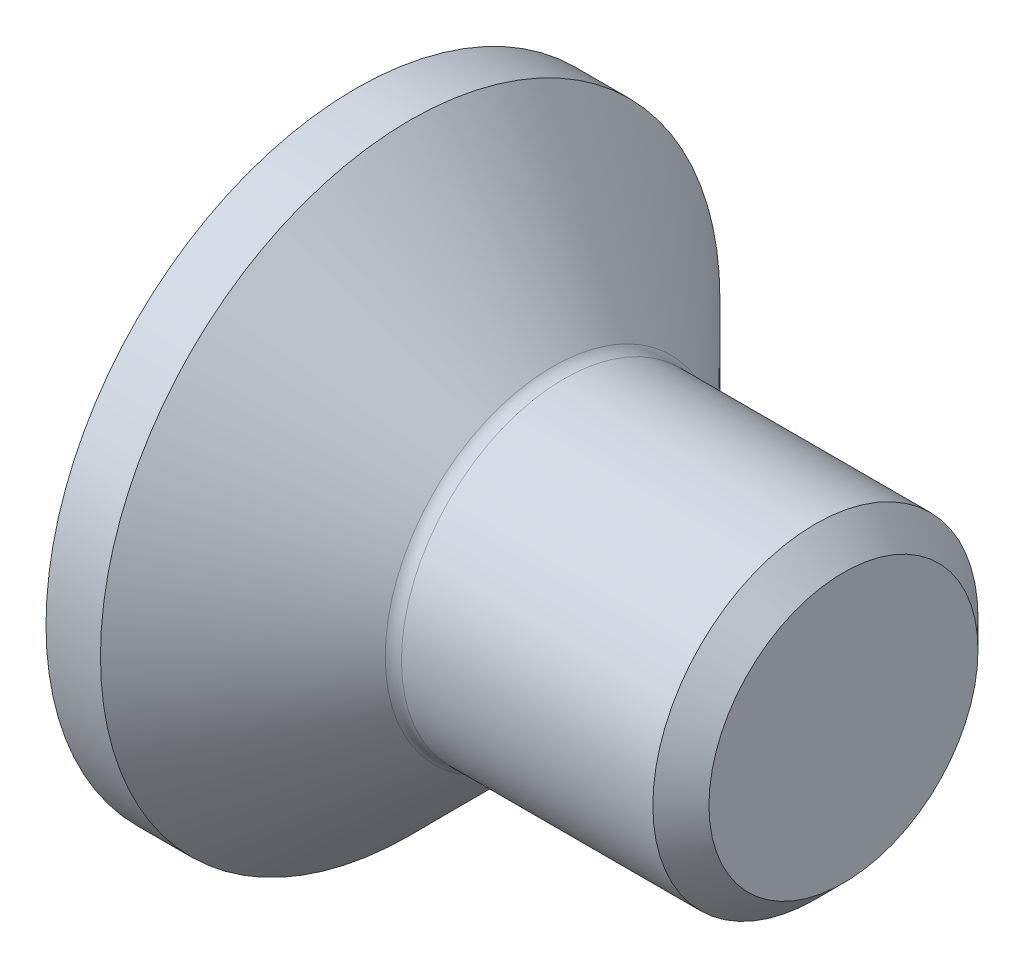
ISO-10303-21;
HEADER;
FILE_DESCRIPTION(('STEP AP214'),'2;1');
FILE_NAME('part.step','',(''),(''),'','','');
FILE_SCHEMA(('AUTOMOTIVE_DESIGN { 1 0 10303 214 1 1 1 1 }'));
ENDSEC;
DATA;
#1=APPLICATION_CONTEXT('core data for automotive mechanical design processes');
#2=APPLICATION_PROTOCOL_DEFINITION('international standard','automotive_design',2000,#1);
#3=PRODUCT_CONTEXT('',#1,'mechanical');
#4=PRODUCT('Part','Part','',(#3));
#5=PRODUCT_RELATED_PRODUCT_CATEGORY('part','',(#4));
#6=PRODUCT_DEFINITION_FORMATION('','',#4);
#7=PRODUCT_DEFINITION_CONTEXT('part definition',#1,'design');
#8=PRODUCT_DEFINITION('design','',#6,#7);
#9=PRODUCT_DEFINITION_SHAPE('','',#8);
#10=(LENGTH_UNIT() NAMED_UNIT(*) SI_UNIT(.MILLI.,.METRE.));
#11=(NAMED_UNIT(*) PLANE_ANGLE_UNIT() SI_UNIT($,.RADIAN.));
#12=(NAMED_UNIT(*) SI_UNIT($,.STERADIAN.) SOLID_ANGLE_UNIT());
#13=UNCERTAINTY_MEASURE_WITH_UNIT(LENGTH_MEASURE(1.E-05),#10,'distance_accuracy_value','');
#14=(GEOMETRIC_REPRESENTATION_CONTEXT(3) GLOBAL_UNCERTAINTY_ASSIGNED_CONTEXT((#13)) GLOBAL_UNIT_ASSIGNED_CONTEXT((#10,
#11,#12)) REPRESENTATION_CONTEXT('',''));
#15=CARTESIAN_POINT('',(0.,0.,0.));
#16=DIRECTION('',(0.,0.,1.));
#17=DIRECTION('',(1.,0.,0.));
#18=AXIS2_PLACEMENT_3D('',#15,#16,#17);
#19=CARTESIAN_POINT('',(0.,0.,0.));
#20=DIRECTION('',(-1.,0.,0.));
#21=DIRECTION('',(0.,0.,1.));
#22=AXIS2_PLACEMENT_3D('',#19,#20,#21);
#23=PLANE('',#22);
#24=CARTESIAN_POINT('',(0.,0.,0.));
#25=DIRECTION('',(-1.,0.,0.));
#26=DIRECTION('',(0.,0.,1.));
#27=AXIS2_PLACEMENT_3D('',#24,#25,#26);
#28=CIRCLE('',#27,7.62);
#29=CARTESIAN_POINT('',(0.,0.,7.62));
#30=VERTEX_POINT('',#29);
#31=EDGE_CURVE('E145',#30,#30,#28,.T.);
#32=ORIENTED_EDGE('',*,*,#31,.T.);
#33=EDGE_LOOP('',(#32));
#34=FACE_BOUND('',#33,.T.);
#35=DIRECTION('',(0.,-0.5,-0.866025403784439));
#36=VECTOR('',#35,1.);
#37=CARTESIAN_POINT('',(0.,-1.44337567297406,2.5));
#38=LINE('',#37,#36);
#39=CARTESIAN_POINT('',(0.,-1.44337567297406,2.5));
#40=VERTEX_POINT('',#39);
#41=CARTESIAN_POINT('',(0.,-2.88675134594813,0.));
#42=VERTEX_POINT('',#41);
#43=EDGE_CURVE('E117',#40,#42,#38,.T.);
#44=ORIENTED_EDGE('',*,*,#43,.T.);
#45=DIRECTION('',(0.,0.5,-0.866025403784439));
#46=VECTOR('',#45,1.);
#47=CARTESIAN_POINT('',(0.,-2.88675134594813,0.));
#48=LINE('',#47,#46);
#49=CARTESIAN_POINT('',(0.,-1.44337567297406,-2.5));
#50=VERTEX_POINT('',#49);
#51=EDGE_CURVE('E47',#42,#50,#48,.T.);
#52=ORIENTED_EDGE('',*,*,#51,.T.);
#53=DIRECTION('',(0.,1.,0.));
#54=VECTOR('',#53,1.);
#55=CARTESIAN_POINT('',(0.,-1.44337567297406,-2.5));
#56=LINE('',#55,#54);
#57=CARTESIAN_POINT('',(0.,1.44337567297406,-2.5));
#58=VERTEX_POINT('',#57);
#59=EDGE_CURVE('E132',#50,#58,#56,.T.);
#60=ORIENTED_EDGE('',*,*,#59,.T.);
#61=DIRECTION('',(0.,0.5,0.866025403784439));
#62=VECTOR('',#61,1.);
#63=CARTESIAN_POINT('',(0.,1.44337567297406,-2.5));
#64=LINE('',#63,#62);
#65=CARTESIAN_POINT('',(0.,2.88675134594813,0.));
#66=VERTEX_POINT('',#65);
#67=EDGE_CURVE('E378',#58,#66,#64,.T.);
#68=ORIENTED_EDGE('',*,*,#67,.T.);
#69=DIRECTION('',(0.,-0.5,0.866025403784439));
#70=VECTOR('',#69,1.);
#71=CARTESIAN_POINT('',(0.,2.88675134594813,0.));
#72=LINE('',#71,#70);
#73=CARTESIAN_POINT('',(0.,1.44337567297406,2.5));
#74=VERTEX_POINT('',#73);
#75=EDGE_CURVE('E381',#66,#74,#72,.T.);
#76=ORIENTED_EDGE('',*,*,#75,.T.);
#77=DIRECTION('',(0.,-1.,0.));
#78=VECTOR('',#77,1.);
#79=CARTESIAN_POINT('',(0.,1.44337567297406,2.5));
#80=LINE('',#79,#78);
#81=EDGE_CURVE('E384',#74,#40,#80,.T.);
#82=ORIENTED_EDGE('',*,*,#81,.T.);
#83=EDGE_LOOP('',(#44,#52,#60,#68,#76,#82));
#84=FACE_BOUND('',#83,.T.);
#85=ADVANCED_FACE('F32',(#34,#84),#23,.T.);
#86=CARTESIAN_POINT('',(12.,3.3095,0.));
#87=DIRECTION('',(1.,0.,0.));
#88=DIRECTION('',(0.,0.,-1.));
#89=AXIS2_PLACEMENT_3D('',#86,#87,#88);
#90=PLANE('',#89);
#91=CARTESIAN_POINT('',(12.,0.,0.));
#92=DIRECTION('',(-1.,0.,0.));
#93=DIRECTION('',(0.,0.,1.));
#94=AXIS2_PLACEMENT_3D('',#91,#92,#93);
#95=CIRCLE('',#94,3.3095);
#96=CARTESIAN_POINT('',(12.,0.,3.3095));
#97=VERTEX_POINT('',#96);
#98=EDGE_CURVE('E155',#97,#97,#95,.T.);
#99=ORIENTED_EDGE('',*,*,#98,.F.);
#100=EDGE_LOOP('',(#99));
#101=FACE_BOUND('',#100,.T.);
#102=ADVANCED_FACE('F175',(#101),#90,.T.);
#103=CARTESIAN_POINT('',(12.,0.,0.));
#104=DIRECTION('',(-1.,0.,0.));
#105=DIRECTION('',(0.,0.,1.));
#106=AXIS2_PLACEMENT_3D('',#103,#104,#105);
#107=CONICAL_SURFACE('',#106,3.3095,0.785398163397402);
#108=CARTESIAN_POINT('',(11.3095,0.,0.));
#109=DIRECTION('',(-1.,0.,0.));
#110=DIRECTION('',(0.,0.,1.));
#111=AXIS2_PLACEMENT_3D('',#108,#109,#110);
#112=CIRCLE('',#111,3.99999999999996);
#113=CARTESIAN_POINT('',(11.3095,0.,3.99999999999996));
#114=VERTEX_POINT('',#113);
#115=EDGE_CURVE('E152',#114,#114,#112,.T.);
#116=ORIENTED_EDGE('',*,*,#115,.F.);
#117=EDGE_LOOP('',(#116));
#118=FACE_BOUND('',#117,.T.);
#119=ORIENTED_EDGE('',*,*,#98,.T.);
#120=EDGE_LOOP('',(#119));
#121=FACE_BOUND('',#120,.T.);
#122=ADVANCED_FACE('F181',(#118,#121),#107,.T.);
#123=CARTESIAN_POINT('',(0.,0.,0.));
#124=DIRECTION('',(-1.,0.,0.));
#125=DIRECTION('',(0.,0.,1.));
#126=AXIS2_PLACEMENT_3D('',#123,#124,#125);
#127=CYLINDRICAL_SURFACE('',#126,3.99999999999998);
#128=CARTESIAN_POINT('',(5.12568542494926,0.,0.));
#129=DIRECTION('',(-1.,0.,0.));
#130=DIRECTION('',(0.,0.,1.));
#131=AXIS2_PLACEMENT_3D('',#128,#129,#130);
#132=CIRCLE('',#131,3.99999999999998);
#133=CARTESIAN_POINT('',(5.12568542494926,0.,3.99999999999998));
#134=VERTEX_POINT('',#133);
#135=EDGE_CURVE('E11',#134,#134,#132,.F.);
#136=ORIENTED_EDGE('',*,*,#135,.T.);
#137=EDGE_LOOP('',(#136));
#138=FACE_BOUND('',#137,.T.);
#139=ORIENTED_EDGE('',*,*,#115,.T.);
#140=EDGE_LOOP('',(#139));
#141=FACE_BOUND('',#140,.T.);
#142=ADVANCED_FACE('F189',(#138,#141),#127,.T.);
#143=CARTESIAN_POINT('',(1.34000000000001,0.,0.));
#144=DIRECTION('',(-1.,0.,0.));
#145=DIRECTION('',(0.,0.,1.));
#146=AXIS2_PLACEMENT_3D('',#143,#144,#145);
#147=CONICAL_SURFACE('',#146,7.62,0.78539816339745);
#148=CARTESIAN_POINT('',(4.84284271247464,0.,0.));
#149=DIRECTION('',(-1.,0.,0.));
#150=DIRECTION('',(0.,0.,1.));
#151=AXIS2_PLACEMENT_3D('',#148,#149,#150);
#152=CIRCLE('',#151,4.11715728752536);
#153=CARTESIAN_POINT('',(4.84284271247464,0.,4.11715728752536));
#154=VERTEX_POINT('',#153);
#155=EDGE_CURVE('E40',#154,#154,#152,.T.);
#156=ORIENTED_EDGE('',*,*,#155,.T.);
#157=EDGE_LOOP('',(#156));
#158=FACE_BOUND('',#157,.T.);
#159=CARTESIAN_POINT('',(1.34000000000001,0.,0.));
#160=DIRECTION('',(-1.,0.,0.));
#161=DIRECTION('',(0.,0.,1.));
#162=AXIS2_PLACEMENT_3D('',#159,#160,#161);
#163=CIRCLE('',#162,7.62);
#164=CARTESIAN_POINT('',(1.34000000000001,0.,7.62));
#165=VERTEX_POINT('',#164);
#166=EDGE_CURVE('E149',#165,#165,#163,.T.);
#167=ORIENTED_EDGE('',*,*,#166,.F.);
#168=EDGE_LOOP('',(#167));
#169=FACE_BOUND('',#168,.T.);
#170=ADVANCED_FACE('F160',(#158,#169),#147,.T.);
#171=CARTESIAN_POINT('',(0.,0.,0.));
#172=DIRECTION('',(-1.,0.,0.));
#173=DIRECTION('',(0.,0.,1.));
#174=AXIS2_PLACEMENT_3D('',#171,#172,#173);
#175=CYLINDRICAL_SURFACE('',#174,7.62);
#176=ORIENTED_EDGE('',*,*,#166,.T.);
#177=EDGE_LOOP('',(#176));
#178=FACE_BOUND('',#177,.T.);
#179=ORIENTED_EDGE('',*,*,#31,.F.);
#180=EDGE_LOOP('',(#179));
#181=FACE_BOUND('',#180,.T.);
#182=ADVANCED_FACE('F164',(#178,#181),#175,.T.);
#183=CARTESIAN_POINT('',(5.12568542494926,0.,0.));
#184=DIRECTION('',(-1.,0.,0.));
#185=DIRECTION('',(0.,0.,1.));
#186=AXIS2_PLACEMENT_3D('',#183,#184,#185);
#187=TOROIDAL_SURFACE('',#186,4.39999999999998,0.4);
#188=ORIENTED_EDGE('',*,*,#135,.F.);
#189=EDGE_LOOP('',(#188));
#190=FACE_BOUND('',#189,.T.);
#191=ORIENTED_EDGE('',*,*,#155,.F.);
#192=EDGE_LOOP('',(#191));
#193=FACE_BOUND('',#192,.T.);
#194=ADVANCED_FACE('F34',(#190,#193),#187,.F.);
#195=CARTESIAN_POINT('',(3.,-2.88675134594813,0.));
#196=DIRECTION('',(0.,0.866025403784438,0.5));
#197=DIRECTION('',(0.,-0.5,0.866025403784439));
#198=AXIS2_PLACEMENT_3D('',#195,#196,#197);
#199=PLANE('',#198);
#200=ORIENTED_EDGE('',*,*,#51,.F.);
#201=DIRECTION('',(-1.,0.,0.));
#202=VECTOR('',#201,1.);
#203=CARTESIAN_POINT('',(3.,-2.88675134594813,0.));
#204=LINE('',#203,#202);
#205=CARTESIAN_POINT('',(3.,-2.88675134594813,0.));
#206=VERTEX_POINT('',#205);
#207=EDGE_CURVE('E375',#206,#42,#204,.T.);
#208=ORIENTED_EDGE('',*,*,#207,.F.);
#209=DIRECTION('',(0.,0.5,-0.866025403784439));
#210=VECTOR('',#209,1.);
#211=CARTESIAN_POINT('',(3.,-2.88675134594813,0.));
#212=LINE('',#211,#210);
#213=CARTESIAN_POINT('',(3.,-2.1650635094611,-1.25));
#214=VERTEX_POINT('',#213);
#215=EDGE_CURVE('E114',#206,#214,#212,.T.);
#216=ORIENTED_EDGE('',*,*,#215,.T.);
#217=CARTESIAN_POINT('',(3.,-1.44337567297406,-2.5));
#218=VERTEX_POINT('',#217);
#219=EDGE_CURVE('E108',#214,#218,#212,.T.);
#220=ORIENTED_EDGE('',*,*,#219,.T.);
#221=DIRECTION('',(-1.,0.,0.));
#222=VECTOR('',#221,1.);
#223=CARTESIAN_POINT('',(3.,-1.44337567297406,-2.5));
#224=LINE('',#223,#222);
#225=EDGE_CURVE('E112',#218,#50,#224,.T.);
#226=ORIENTED_EDGE('',*,*,#225,.T.);
#227=EDGE_LOOP('',(#200,#208,#216,#220,#226));
#228=FACE_BOUND('',#227,.T.);
#229=ADVANCED_FACE('F110',(#228),#199,.T.);
#230=CARTESIAN_POINT('',(3.,-1.44337567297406,-2.5));
#231=DIRECTION('',(0.,0.,1.));
#232=DIRECTION('',(1.,0.,0.));
#233=AXIS2_PLACEMENT_3D('',#230,#231,#232);
#234=PLANE('',#233);
#235=ORIENTED_EDGE('',*,*,#59,.F.);
#236=ORIENTED_EDGE('',*,*,#225,.F.);
#237=DIRECTION('',(0.,1.,0.));
#238=VECTOR('',#237,1.);
#239=CARTESIAN_POINT('',(3.,-1.44337567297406,-2.5));
#240=LINE('',#239,#238);
#241=CARTESIAN_POINT('',(3.,0.,-2.5));
#242=VERTEX_POINT('',#241);
#243=EDGE_CURVE('E120',#218,#242,#240,.T.);
#244=ORIENTED_EDGE('',*,*,#243,.T.);
#245=CARTESIAN_POINT('',(3.,1.44337567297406,-2.5));
#246=VERTEX_POINT('',#245);
#247=EDGE_CURVE('E127',#242,#246,#240,.T.);
#248=ORIENTED_EDGE('',*,*,#247,.T.);
#249=DIRECTION('',(-1.,0.,0.));
#250=VECTOR('',#249,1.);
#251=CARTESIAN_POINT('',(3.,1.44337567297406,-2.5));
#252=LINE('',#251,#250);
#253=EDGE_CURVE('E134',#246,#58,#252,.T.);
#254=ORIENTED_EDGE('',*,*,#253,.T.);
#255=EDGE_LOOP('',(#235,#236,#244,#248,#254));
#256=FACE_BOUND('',#255,.T.);
#257=ADVANCED_FACE('F129',(#256),#234,.T.);
#258=CARTESIAN_POINT('',(3.,1.44337567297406,-2.5));
#259=DIRECTION('',(0.,-0.866025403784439,0.5));
#260=DIRECTION('',(0.,-0.5,-0.866025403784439));
#261=AXIS2_PLACEMENT_3D('',#258,#259,#260);
#262=PLANE('',#261);
#263=ORIENTED_EDGE('',*,*,#67,.F.);
#264=ORIENTED_EDGE('',*,*,#253,.F.);
#265=DIRECTION('',(0.,0.5,0.866025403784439));
#266=VECTOR('',#265,1.);
#267=CARTESIAN_POINT('',(3.,1.44337567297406,-2.5));
#268=LINE('',#267,#266);
#269=CARTESIAN_POINT('',(3.,2.1650635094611,-1.25));
#270=VERTEX_POINT('',#269);
#271=EDGE_CURVE('E368',#246,#270,#268,.T.);
#272=ORIENTED_EDGE('',*,*,#271,.T.);
#273=CARTESIAN_POINT('',(3.,2.88675134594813,0.));
#274=VERTEX_POINT('',#273);
#275=EDGE_CURVE('E126',#270,#274,#268,.T.);
#276=ORIENTED_EDGE('',*,*,#275,.T.);
#277=DIRECTION('',(-1.,0.,0.));
#278=VECTOR('',#277,1.);
#279=CARTESIAN_POINT('',(3.,2.88675134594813,0.));
#280=LINE('',#279,#278);
#281=EDGE_CURVE('E140',#274,#66,#280,.T.);
#282=ORIENTED_EDGE('',*,*,#281,.T.);
#283=EDGE_LOOP('',(#263,#264,#272,#276,#282));
#284=FACE_BOUND('',#283,.T.);
#285=ADVANCED_FACE('F249',(#284),#262,.T.);
#286=CARTESIAN_POINT('',(3.,2.88675134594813,0.));
#287=DIRECTION('',(0.,-0.866025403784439,-0.5));
#288=DIRECTION('',(0.,0.5,-0.866025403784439));
#289=AXIS2_PLACEMENT_3D('',#286,#287,#288);
#290=PLANE('',#289);
#291=ORIENTED_EDGE('',*,*,#75,.F.);
#292=ORIENTED_EDGE('',*,*,#281,.F.);
#293=DIRECTION('',(0.,-0.5,0.866025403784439));
#294=VECTOR('',#293,1.);
#295=CARTESIAN_POINT('',(3.,2.88675134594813,0.));
#296=LINE('',#295,#294);
#297=CARTESIAN_POINT('',(3.,2.1650635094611,1.25));
#298=VERTEX_POINT('',#297);
#299=EDGE_CURVE('E55',#274,#298,#296,.T.);
#300=ORIENTED_EDGE('',*,*,#299,.T.);
#301=CARTESIAN_POINT('',(3.,1.44337567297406,2.5));
#302=VERTEX_POINT('',#301);
#303=EDGE_CURVE('E347',#298,#302,#296,.T.);
#304=ORIENTED_EDGE('',*,*,#303,.T.);
#305=DIRECTION('',(-1.,0.,0.));
#306=VECTOR('',#305,1.);
#307=CARTESIAN_POINT('',(3.,1.44337567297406,2.5));
#308=LINE('',#307,#306);
#309=EDGE_CURVE('E361',#302,#74,#308,.T.);
#310=ORIENTED_EDGE('',*,*,#309,.T.);
#311=EDGE_LOOP('',(#291,#292,#300,#304,#310));
#312=FACE_BOUND('',#311,.T.);
#313=ADVANCED_FACE('F257',(#312),#290,.T.);
#314=CARTESIAN_POINT('',(3.,1.44337567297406,2.5));
#315=DIRECTION('',(0.,0.,-1.));
#316=DIRECTION('',(-1.,0.,0.));
#317=AXIS2_PLACEMENT_3D('',#314,#315,#316);
#318=PLANE('',#317);
#319=ORIENTED_EDGE('',*,*,#81,.F.);
#320=ORIENTED_EDGE('',*,*,#309,.F.);
#321=DIRECTION('',(0.,-1.,0.));
#322=VECTOR('',#321,1.);
#323=CARTESIAN_POINT('',(3.,1.44337567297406,2.5));
#324=LINE('',#323,#322);
#325=CARTESIAN_POINT('',(3.,0.,2.5));
#326=VERTEX_POINT('',#325);
#327=EDGE_CURVE('E346',#302,#326,#324,.T.);
#328=ORIENTED_EDGE('',*,*,#327,.T.);
#329=CARTESIAN_POINT('',(3.,-1.44337567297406,2.5));
#330=VERTEX_POINT('',#329);
#331=EDGE_CURVE('E352',#326,#330,#324,.T.);
#332=ORIENTED_EDGE('',*,*,#331,.T.);
#333=DIRECTION('',(-1.,0.,0.));
#334=VECTOR('',#333,1.);
#335=CARTESIAN_POINT('',(3.,-1.44337567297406,2.5));
#336=LINE('',#335,#334);
#337=EDGE_CURVE('E390',#330,#40,#336,.T.);
#338=ORIENTED_EDGE('',*,*,#337,.T.);
#339=EDGE_LOOP('',(#319,#320,#328,#332,#338));
#340=FACE_BOUND('',#339,.T.);
#341=ADVANCED_FACE('F266',(#340),#318,.T.);
#342=CARTESIAN_POINT('',(3.,-1.44337567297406,2.5));
#343=DIRECTION('',(0.,0.866025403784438,-0.5));
#344=DIRECTION('',(0.,0.5,0.866025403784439));
#345=AXIS2_PLACEMENT_3D('',#342,#343,#344);
#346=PLANE('',#345);
#347=ORIENTED_EDGE('',*,*,#43,.F.);
#348=ORIENTED_EDGE('',*,*,#337,.F.);
#349=DIRECTION('',(0.,-0.5,-0.866025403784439));
#350=VECTOR('',#349,1.);
#351=CARTESIAN_POINT('',(3.,-1.44337567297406,2.5));
#352=LINE('',#351,#350);
#353=CARTESIAN_POINT('',(3.,-2.1650635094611,1.25));
#354=VERTEX_POINT('',#353);
#355=EDGE_CURVE('E355',#330,#354,#352,.T.);
#356=ORIENTED_EDGE('',*,*,#355,.T.);
#357=EDGE_CURVE('E362',#354,#206,#352,.T.);
#358=ORIENTED_EDGE('',*,*,#357,.T.);
#359=ORIENTED_EDGE('',*,*,#207,.T.);
#360=EDGE_LOOP('',(#347,#348,#356,#358,#359));
#361=FACE_BOUND('',#360,.T.);
#362=ADVANCED_FACE('F274',(#361),#346,.T.);
#363=CARTESIAN_POINT('',(3.,-2.88675134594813,0.));
#364=DIRECTION('',(-1.,0.,0.));
#365=DIRECTION('',(0.,0.,1.));
#366=AXIS2_PLACEMENT_3D('',#363,#364,#365);
#367=PLANE('',#366);
#368=CARTESIAN_POINT('',(3.,0.,0.));
#369=DIRECTION('',(-1.,0.,0.));
#370=DIRECTION('',(0.,0.,1.));
#371=AXIS2_PLACEMENT_3D('',#368,#369,#370);
#372=CIRCLE('',#371,2.5);
#373=EDGE_CURVE('E133',#354,#326,#372,.T.);
#374=ORIENTED_EDGE('',*,*,#373,.F.);
#375=ORIENTED_EDGE('',*,*,#355,.F.);
#376=ORIENTED_EDGE('',*,*,#331,.F.);
#377=EDGE_LOOP('',(#374,#375,#376));
#378=FACE_BOUND('',#377,.T.);
#379=ADVANCED_FACE('F283',(#378),#367,.T.);
#380=EDGE_CURVE('E137',#214,#354,#372,.T.);
#381=ORIENTED_EDGE('',*,*,#380,.F.);
#382=ORIENTED_EDGE('',*,*,#215,.F.);
#383=ORIENTED_EDGE('',*,*,#357,.F.);
#384=EDGE_LOOP('',(#381,#382,#383));
#385=FACE_BOUND('',#384,.T.);
#386=ADVANCED_FACE('F292',(#385),#367,.T.);
#387=EDGE_CURVE('E122',#242,#214,#372,.T.);
#388=ORIENTED_EDGE('',*,*,#387,.F.);
#389=ORIENTED_EDGE('',*,*,#243,.F.);
#390=ORIENTED_EDGE('',*,*,#219,.F.);
#391=EDGE_LOOP('',(#388,#389,#390));
#392=FACE_BOUND('',#391,.T.);
#393=ADVANCED_FACE('F121',(#392),#367,.T.);
#394=EDGE_CURVE('E364',#270,#242,#372,.T.);
#395=ORIENTED_EDGE('',*,*,#394,.F.);
#396=ORIENTED_EDGE('',*,*,#271,.F.);
#397=ORIENTED_EDGE('',*,*,#247,.F.);
#398=EDGE_LOOP('',(#395,#396,#397));
#399=FACE_BOUND('',#398,.T.);
#400=ADVANCED_FACE('F308',(#399),#367,.T.);
#401=EDGE_CURVE('E146',#298,#270,#372,.T.);
#402=ORIENTED_EDGE('',*,*,#401,.F.);
#403=ORIENTED_EDGE('',*,*,#299,.F.);
#404=ORIENTED_EDGE('',*,*,#275,.F.);
#405=EDGE_LOOP('',(#402,#403,#404));
#406=FACE_BOUND('',#405,.T.);
#407=ADVANCED_FACE('F315',(#406),#367,.T.);
#408=EDGE_CURVE('E139',#326,#298,#372,.T.);
#409=ORIENTED_EDGE('',*,*,#408,.F.);
#410=ORIENTED_EDGE('',*,*,#327,.F.);
#411=ORIENTED_EDGE('',*,*,#303,.F.);
#412=EDGE_LOOP('',(#409,#410,#411));
#413=FACE_BOUND('',#412,.T.);
#414=ADVANCED_FACE('F231',(#413),#367,.T.);
#415=CARTESIAN_POINT('',(3.,0.,0.));
#416=DIRECTION('',(-1.,0.,0.));
#417=DIRECTION('',(0.,0.,1.));
#418=AXIS2_PLACEMENT_3D('',#415,#416,#417);
#419=CONICAL_SURFACE('',#418,2.5,1.04719755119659);
#420=CARTESIAN_POINT('',(4.44337567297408,0.,0.));
#421=VERTEX_POINT('',#420);
#422=VERTEX_LOOP('',#421);
#423=FACE_BOUND('',#422,.T.);
#424=ORIENTED_EDGE('',*,*,#408,.T.);
#425=ORIENTED_EDGE('',*,*,#401,.T.);
#426=ORIENTED_EDGE('',*,*,#394,.T.);
#427=ORIENTED_EDGE('',*,*,#387,.T.);
#428=ORIENTED_EDGE('',*,*,#380,.T.);
#429=ORIENTED_EDGE('',*,*,#373,.T.);
#430=EDGE_LOOP('',(#424,#425,#426,#427,#428,#429));
#431=FACE_BOUND('',#430,.T.);
#432=ADVANCED_FACE('F185',(#423,#431),#419,.F.);
#433=CLOSED_SHELL('',(#85,#102,#122,#142,#170,#182,#194,#229,#257,#285,#313,#341,#362,#379,#386,
#393,#400,#407,#414,#432));
#434=MANIFOLD_SOLID_BREP('B2',#433);
#435=ADVANCED_BREP_SHAPE_REPRESENTATION('',(#18,#434),#14);
#436=SHAPE_DEFINITION_REPRESENTATION(#9,#435);
ENDSEC;
END-ISO-10303-21;
